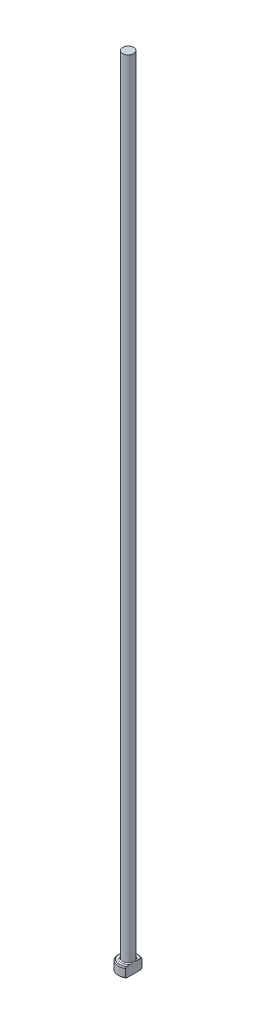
ISO-10303-21;
HEADER;
FILE_DESCRIPTION(('STEP AP214'),'2;1');
FILE_NAME('part.step','',(''),(''),'','','');
FILE_SCHEMA(('AUTOMOTIVE_DESIGN { 1 0 10303 214 1 1 1 1 }'));
ENDSEC;
DATA;
#1=APPLICATION_CONTEXT('core data for automotive mechanical design processes');
#2=APPLICATION_PROTOCOL_DEFINITION('international standard','automotive_design',2000,#1);
#3=PRODUCT_CONTEXT('',#1,'mechanical');
#4=PRODUCT('Part','Part','',(#3));
#5=PRODUCT_RELATED_PRODUCT_CATEGORY('part','',(#4));
#6=PRODUCT_DEFINITION_FORMATION('','',#4);
#7=PRODUCT_DEFINITION_CONTEXT('part definition',#1,'design');
#8=PRODUCT_DEFINITION('design','',#6,#7);
#9=PRODUCT_DEFINITION_SHAPE('','',#8);
#10=(LENGTH_UNIT() NAMED_UNIT(*) SI_UNIT(.MILLI.,.METRE.));
#11=(NAMED_UNIT(*) PLANE_ANGLE_UNIT() SI_UNIT($,.RADIAN.));
#12=(NAMED_UNIT(*) SI_UNIT($,.STERADIAN.) SOLID_ANGLE_UNIT());
#13=UNCERTAINTY_MEASURE_WITH_UNIT(LENGTH_MEASURE(1.E-05),#10,'distance_accuracy_value','');
#14=(GEOMETRIC_REPRESENTATION_CONTEXT(3) GLOBAL_UNCERTAINTY_ASSIGNED_CONTEXT((#13)) GLOBAL_UNIT_ASSIGNED_CONTEXT((#10,
#11,#12)) REPRESENTATION_CONTEXT('',''));
#15=CARTESIAN_POINT('',(0.,0.,0.));
#16=DIRECTION('',(0.,0.,1.));
#17=DIRECTION('',(1.,0.,0.));
#18=AXIS2_PLACEMENT_3D('',#15,#16,#17);
#19=CARTESIAN_POINT('',(0.,0.,0.));
#20=DIRECTION('',(0.,-1.,0.));
#21=DIRECTION('',(0.,0.,-1.));
#22=AXIS2_PLACEMENT_3D('',#19,#20,#21);
#23=PLANE('',#22);
#24=CARTESIAN_POINT('',(0.,0.,0.));
#25=DIRECTION('',(0.,-1.,0.));
#26=DIRECTION('',(0.,0.,-1.));
#27=AXIS2_PLACEMENT_3D('',#24,#25,#26);
#28=CIRCLE('',#27,1.79999999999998);
#29=CARTESIAN_POINT('',(1.09999999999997,0.,1.4247806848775));
#30=VERTEX_POINT('',#29);
#31=CARTESIAN_POINT('',(1.09999999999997,0.,-1.4247806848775));
#32=VERTEX_POINT('',#31);
#33=EDGE_CURVE('E98',#30,#32,#28,.T.);
#34=ORIENTED_EDGE('',*,*,#33,.T.);
#35=DIRECTION('',(0.,0.,1.));
#36=VECTOR('',#35,1.);
#37=CARTESIAN_POINT('',(1.09999999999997,0.,-1.67032930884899));
#38=LINE('',#37,#36);
#39=EDGE_CURVE('E83',#32,#30,#38,.T.);
#40=ORIENTED_EDGE('',*,*,#39,.T.);
#41=EDGE_LOOP('',(#34,#40));
#42=FACE_BOUND('',#41,.T.);
#43=ADVANCED_FACE('F32',(#42),#23,.T.);
#44=CARTESIAN_POINT('',(0.,259.958771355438,0.));
#45=DIRECTION('',(0.,1.,0.));
#46=DIRECTION('',(0.,0.,1.));
#47=AXIS2_PLACEMENT_3D('',#44,#45,#46);
#48=CYLINDRICAL_SURFACE('',#47,1.99999999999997);
#49=CARTESIAN_POINT('',(0.,1.79999999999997,0.));
#50=DIRECTION('',(0.,1.,0.));
#51=DIRECTION('',(0.,0.,1.));
#52=AXIS2_PLACEMENT_3D('',#49,#50,#51);
#53=CIRCLE('',#52,1.99999999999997);
#54=CARTESIAN_POINT('',(1.09999999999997,1.79999999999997,1.67032930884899));
#55=VERTEX_POINT('',#54);
#56=CARTESIAN_POINT('',(1.09999999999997,1.79999999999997,-1.67032930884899));
#57=VERTEX_POINT('',#56);
#58=EDGE_CURVE('E104',#55,#57,#53,.F.);
#59=ORIENTED_EDGE('',*,*,#58,.T.);
#60=DIRECTION('',(0.,-1.,0.));
#61=VECTOR('',#60,1.);
#62=CARTESIAN_POINT('',(1.09999999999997,160.,-1.67032930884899));
#63=LINE('',#62,#61);
#64=CARTESIAN_POINT('',(1.09999999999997,0.199999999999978,-1.67032930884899));
#65=VERTEX_POINT('',#64);
#66=EDGE_CURVE('E183',#57,#65,#63,.T.);
#67=ORIENTED_EDGE('',*,*,#66,.T.);
#68=CARTESIAN_POINT('',(0.,0.199999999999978,0.));
#69=DIRECTION('',(0.,-1.,0.));
#70=DIRECTION('',(0.,0.,-1.));
#71=AXIS2_PLACEMENT_3D('',#68,#69,#70);
#72=CIRCLE('',#71,1.99999999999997);
#73=CARTESIAN_POINT('',(1.09999999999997,0.199999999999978,1.67032930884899));
#74=VERTEX_POINT('',#73);
#75=EDGE_CURVE('E100',#65,#74,#72,.F.);
#76=ORIENTED_EDGE('',*,*,#75,.T.);
#77=DIRECTION('',(0.,-1.,0.));
#78=VECTOR('',#77,1.);
#79=CARTESIAN_POINT('',(1.09999999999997,160.,1.67032930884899));
#80=LINE('',#79,#78);
#81=EDGE_CURVE('E93',#55,#74,#80,.T.);
#82=ORIENTED_EDGE('',*,*,#81,.F.);
#83=EDGE_LOOP('',(#59,#67,#76,#82));
#84=FACE_BOUND('',#83,.T.);
#85=ADVANCED_FACE('F158',(#84),#48,.T.);
#86=CARTESIAN_POINT('',(-1.99999999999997,2.,0.));
#87=DIRECTION('',(0.,1.,0.));
#88=DIRECTION('',(0.,0.,1.));
#89=AXIS2_PLACEMENT_3D('',#86,#87,#88);
#90=PLANE('',#89);
#91=CARTESIAN_POINT('',(0.,2.,0.));
#92=DIRECTION('',(0.,1.,0.));
#93=DIRECTION('',(0.,0.,1.));
#94=AXIS2_PLACEMENT_3D('',#91,#92,#93);
#95=CIRCLE('',#94,1.79999999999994);
#96=CARTESIAN_POINT('',(1.09999999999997,2.,-1.42478068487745));
#97=VERTEX_POINT('',#96);
#98=CARTESIAN_POINT('',(1.09999999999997,2.,1.42478068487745));
#99=VERTEX_POINT('',#98);
#100=EDGE_CURVE('E178',#97,#99,#95,.T.);
#101=ORIENTED_EDGE('',*,*,#100,.T.);
#102=DIRECTION('',(0.,0.,-1.));
#103=VECTOR('',#102,1.);
#104=CARTESIAN_POINT('',(1.09999999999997,2.,0.));
#105=LINE('',#104,#103);
#106=CARTESIAN_POINT('',(1.09999999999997,1.99999999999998,0.692820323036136));
#107=VERTEX_POINT('',#106);
#108=EDGE_CURVE('E57',#99,#107,#105,.T.);
#109=ORIENTED_EDGE('',*,*,#108,.T.);
#110=CARTESIAN_POINT('',(0.,2.,0.));
#111=DIRECTION('',(0.,1.,0.));
#112=DIRECTION('',(0.,0.,1.));
#113=AXIS2_PLACEMENT_3D('',#110,#111,#112);
#114=CIRCLE('',#113,1.29999999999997);
#115=CARTESIAN_POINT('',(1.09999999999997,1.99999999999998,-0.692820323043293));
#116=VERTEX_POINT('',#115);
#117=EDGE_CURVE('E107',#107,#116,#114,.F.);
#118=ORIENTED_EDGE('',*,*,#117,.T.);
#119=EDGE_CURVE('E136',#116,#97,#105,.T.);
#120=ORIENTED_EDGE('',*,*,#119,.T.);
#121=EDGE_LOOP('',(#101,#109,#118,#120));
#122=FACE_BOUND('',#121,.T.);
#123=ADVANCED_FACE('F147',(#122),#90,.T.);
#124=CARTESIAN_POINT('',(0.,2.,0.));
#125=DIRECTION('',(0.,-1.,0.));
#126=DIRECTION('',(0.,0.,-1.));
#127=AXIS2_PLACEMENT_3D('',#124,#125,#126);
#128=CONICAL_SURFACE('',#127,1.79999999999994,0.785398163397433);
#129=ORIENTED_EDGE('',*,*,#58,.F.);
#130=CARTESIAN_POINT('',(1.09999999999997,-0.0394609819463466,3.67851337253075));
#131=CARTESIAN_POINT('',(1.09999999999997,0.0938871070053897,3.53927086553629));
#132=CARTESIAN_POINT('',(1.09999999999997,0.226969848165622,3.39976850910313));
#133=CARTESIAN_POINT('',(1.09999999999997,0.492235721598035,3.11984283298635));
#134=CARTESIAN_POINT('',(1.09999999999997,0.624418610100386,2.97941928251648));
#135=CARTESIAN_POINT('',(1.09999999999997,0.887405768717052,2.69736523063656));
#136=CARTESIAN_POINT('',(1.09999999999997,1.01821044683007,2.55573511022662));
#137=CARTESIAN_POINT('',(1.09999999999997,1.27771059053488,2.27057337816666));
#138=CARTESIAN_POINT('',(1.09999999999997,1.40640632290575,2.12704201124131));
#139=CARTESIAN_POINT('',(1.09999999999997,1.59274008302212,1.91391242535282));
#140=CARTESIAN_POINT('',(1.09999999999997,1.65179690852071,1.84555665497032));
#141=CARTESIAN_POINT('',(1.09999999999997,1.76883123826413,1.7079133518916));
#142=CARTESIAN_POINT('',(1.09999999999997,1.82680864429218,1.63862573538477));
#143=CARTESIAN_POINT('',(1.09999999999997,1.94139081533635,1.49868129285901));
#144=CARTESIAN_POINT('',(1.09999999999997,1.99799249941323,1.42802193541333));
#145=CARTESIAN_POINT('',(1.09999999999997,2.10905321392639,1.28504453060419));
#146=CARTESIAN_POINT('',(1.09999999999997,2.16351265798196,1.21272680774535));
#147=CARTESIAN_POINT('',(1.09999999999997,2.25351962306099,1.08760351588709));
#148=CARTESIAN_POINT('',(1.09999999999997,2.28987864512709,1.03538457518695));
#149=CARTESIAN_POINT('',(1.09999999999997,2.36041465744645,0.92949954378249));
#150=CARTESIAN_POINT('',(1.09999999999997,2.39459216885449,0.875833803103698));
#151=CARTESIAN_POINT('',(1.09999999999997,2.45984644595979,0.766757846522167));
#152=CARTESIAN_POINT('',(1.09999999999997,2.49092891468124,0.711351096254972));
#153=CARTESIAN_POINT('',(1.09999999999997,2.54873716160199,0.598347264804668));
#154=CARTESIAN_POINT('',(1.09999999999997,2.57546692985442,0.540752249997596));
#155=CARTESIAN_POINT('',(1.09999999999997,2.62531671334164,0.41646762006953));
#156=CARTESIAN_POINT('',(1.09999999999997,2.64771917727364,0.349473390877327));
#157=CARTESIAN_POINT('',(1.09999999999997,2.67308404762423,0.247046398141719));
#158=CARTESIAN_POINT('',(1.09999999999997,2.68016204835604,0.212626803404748));
#159=CARTESIAN_POINT('',(1.09999999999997,2.69123178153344,0.143302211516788));
#160=CARTESIAN_POINT('',(1.09999999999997,2.69522514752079,0.108397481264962));
#161=CARTESIAN_POINT('',(1.09999999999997,2.6999066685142,0.0380394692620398));
#162=CARTESIAN_POINT('',(1.09999999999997,2.70056409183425,0.00258409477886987));
#163=CARTESIAN_POINT('',(1.09999999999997,2.69845711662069,-0.0682167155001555));
#164=CARTESIAN_POINT('',(1.09999999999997,2.695692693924,-0.103562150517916));
#165=CARTESIAN_POINT('',(1.09999999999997,2.68246916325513,-0.209100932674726));
#166=CARTESIAN_POINT('',(1.09999999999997,2.66707429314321,-0.278705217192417));
#167=CARTESIAN_POINT('',(1.09999999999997,2.6311290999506,-0.398409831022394));
#168=CARTESIAN_POINT('',(1.09999999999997,2.61268926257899,-0.449196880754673));
#169=CARTESIAN_POINT('',(1.09999999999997,2.5714477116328,-0.548998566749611));
#170=CARTESIAN_POINT('',(1.09999999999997,2.5486426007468,-0.598011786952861));
#171=CARTESIAN_POINT('',(1.09999999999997,2.49970814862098,-0.694626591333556));
#172=CARTESIAN_POINT('',(1.09999999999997,2.47356275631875,-0.74221989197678));
#173=CARTESIAN_POINT('',(1.09999999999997,2.41890398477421,-0.835986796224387));
#174=CARTESIAN_POINT('',(1.09999999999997,2.39039158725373,-0.882160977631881));
#175=CARTESIAN_POINT('',(1.09999999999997,2.32625511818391,-0.981643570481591));
#176=CARTESIAN_POINT('',(1.09999999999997,2.2902800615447,-1.03472421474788));
#177=CARTESIAN_POINT('',(1.09999999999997,2.21653305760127,-1.13962743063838));
#178=CARTESIAN_POINT('',(1.09999999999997,2.17876074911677,-1.19144974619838));
#179=CARTESIAN_POINT('',(1.09999999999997,2.06341857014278,-1.34551007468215));
#180=CARTESIAN_POINT('',(1.09999999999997,1.98387469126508,-1.44626517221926));
#181=CARTESIAN_POINT('',(1.09999999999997,1.82152847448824,-1.64549240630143));
#182=CARTESIAN_POINT('',(1.09999999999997,1.73871851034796,-1.74395822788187));
#183=CARTESIAN_POINT('',(1.09999999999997,1.57115072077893,-1.93914128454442));
#184=CARTESIAN_POINT('',(1.09999999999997,1.48639373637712,-2.03585924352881));
#185=CARTESIAN_POINT('',(1.09999999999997,1.3154590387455,-2.22820182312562));
#186=CARTESIAN_POINT('',(1.09999999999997,1.22927997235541,-2.32382523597));
#187=CARTESIAN_POINT('',(1.09999999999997,1.05596320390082,-2.51421569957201));
#188=CARTESIAN_POINT('',(1.09999999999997,0.968825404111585,-2.6089826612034));
#189=CARTESIAN_POINT('',(1.09999999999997,0.706597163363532,-2.89210208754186));
#190=CARTESIAN_POINT('',(1.09999999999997,0.530482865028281,-3.07950542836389));
#191=CARTESIAN_POINT('',(1.09999999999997,0.28821930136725,-3.33512571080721));
#192=CARTESIAN_POINT('',(1.09999999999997,0.222748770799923,-3.40399021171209));
#193=CARTESIAN_POINT('',(1.09999999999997,0.0917246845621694,-3.54143252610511));
#194=CARTESIAN_POINT('',(1.09999999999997,0.0261714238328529,-3.61001062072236));
#195=CARTESIAN_POINT('',(1.09999999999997,-0.0394609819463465,-3.67851337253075));
#196=B_SPLINE_CURVE_WITH_KNOTS('',3,(#130,#131,#132,#133,#134,#135,#136,#137,#138,#139,#140,
#141,#142,#143,#144,#145,#146,#147,#148,#149,#150,#151,#152,#153,#154,#155,#156,#157,#158,#159,
#160,#161,#162,#163,#164,#165,#166,#167,#168,#169,#170,#171,#172,#173,#174,#175,#176,#177,#178,
#179,#180,#181,#182,#183,#184,#185,#186,#187,#188,#189,#190,#191,#192,#193,#194,#195),
.UNSPECIFIED.,.F.,.F.,(4,2,2,2,2,2,2,2,2,2,2,2,2,2,2,2,2,2,2,2,2,2,2,2,2,2,2,2,2,2,2,2,4),(0.,
0.578393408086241,1.15693772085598,1.73530565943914,2.31359986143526,2.58459381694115,
2.85561231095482,3.12719032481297,3.39871564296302,3.58956709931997,3.78037278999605,
3.97082012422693,4.16109188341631,4.37223430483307,4.47753596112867,4.58278181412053,
4.68899548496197,4.79520990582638,5.00790932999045,5.16979123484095,5.33179964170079,
5.49461809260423,5.65736934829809,5.84968611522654,6.042041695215,6.42702818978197,
6.81297408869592,7.1987562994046,7.58492959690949,7.97114262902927,8.74263124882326,
9.02768991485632,9.3122978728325),.UNSPECIFIED.);
#197=EDGE_CURVE('E135',#55,#99,#196,.T.);
#198=ORIENTED_EDGE('',*,*,#197,.T.);
#199=ORIENTED_EDGE('',*,*,#100,.F.);
#200=EDGE_CURVE('E127',#97,#57,#196,.T.);
#201=ORIENTED_EDGE('',*,*,#200,.T.);
#202=EDGE_LOOP('',(#129,#198,#199,#201));
#203=FACE_BOUND('',#202,.T.);
#204=ADVANCED_FACE('F143',(#203),#128,.T.);
#205=CARTESIAN_POINT('',(0.,0.199999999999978,0.));
#206=DIRECTION('',(0.,1.,0.));
#207=DIRECTION('',(0.,0.,1.));
#208=AXIS2_PLACEMENT_3D('',#205,#206,#207);
#209=CONICAL_SURFACE('',#208,1.99999999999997,0.785398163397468);
#210=ORIENTED_EDGE('',*,*,#75,.F.);
#211=CARTESIAN_POINT('',(1.09999999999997,2.03946098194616,-3.67851337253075));
#212=CARTESIAN_POINT('',(1.09999999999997,1.90611289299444,-3.53927086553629));
#213=CARTESIAN_POINT('',(1.09999999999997,1.77303015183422,-3.39976850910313));
#214=CARTESIAN_POINT('',(1.09999999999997,1.50776427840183,-3.11984283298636));
#215=CARTESIAN_POINT('',(1.09999999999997,1.37558138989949,-2.9794192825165));
#216=CARTESIAN_POINT('',(1.09999999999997,1.11259423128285,-2.69736523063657));
#217=CARTESIAN_POINT('',(1.09999999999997,0.981789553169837,-2.55573511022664));
#218=CARTESIAN_POINT('',(1.09999999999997,0.722289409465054,-2.27057337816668));
#219=CARTESIAN_POINT('',(1.09999999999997,0.593593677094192,-2.12704201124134));
#220=CARTESIAN_POINT('',(1.09999999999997,0.407259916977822,-1.91391242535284));
#221=CARTESIAN_POINT('',(1.09999999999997,0.348203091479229,-1.84555665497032));
#222=CARTESIAN_POINT('',(1.09999999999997,0.231168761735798,-1.70791335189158));
#223=CARTESIAN_POINT('',(1.09999999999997,0.173191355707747,-1.63862573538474));
#224=CARTESIAN_POINT('',(1.09999999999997,0.0586091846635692,-1.49868129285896));
#225=CARTESIAN_POINT('',(1.09999999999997,0.00200750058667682,-1.42802193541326));
#226=CARTESIAN_POINT('',(1.09999999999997,-0.10905321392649,-1.2850445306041));
#227=CARTESIAN_POINT('',(1.09999999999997,-0.163512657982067,-1.21272680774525));
#228=CARTESIAN_POINT('',(1.09999999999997,-0.253519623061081,-1.08760351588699));
#229=CARTESIAN_POINT('',(1.09999999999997,-0.289878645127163,-1.03538457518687));
#230=CARTESIAN_POINT('',(1.09999999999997,-0.360414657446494,-0.929499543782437));
#231=CARTESIAN_POINT('',(1.09999999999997,-0.394592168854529,-0.87583380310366));
#232=CARTESIAN_POINT('',(1.09999999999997,-0.459846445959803,-0.76675784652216));
#233=CARTESIAN_POINT('',(1.09999999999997,-0.490928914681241,-0.711351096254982));
#234=CARTESIAN_POINT('',(1.09999999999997,-0.548737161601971,-0.598347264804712));
#235=CARTESIAN_POINT('',(1.09999999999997,-0.575466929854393,-0.540752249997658));
#236=CARTESIAN_POINT('',(1.09999999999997,-0.625316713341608,-0.416467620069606));
#237=CARTESIAN_POINT('',(1.09999999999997,-0.647719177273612,-0.349473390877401));
#238=CARTESIAN_POINT('',(1.09999999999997,-0.673084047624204,-0.247046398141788));
#239=CARTESIAN_POINT('',(1.09999999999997,-0.680162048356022,-0.212626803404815));
#240=CARTESIAN_POINT('',(1.09999999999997,-0.691231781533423,-0.143302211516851));
#241=CARTESIAN_POINT('',(1.09999999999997,-0.695225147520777,-0.108397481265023));
#242=CARTESIAN_POINT('',(1.09999999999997,-0.699906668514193,-0.0380394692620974));
#243=CARTESIAN_POINT('',(1.09999999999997,-0.700564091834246,-0.00258409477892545));
#244=CARTESIAN_POINT('',(1.09999999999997,-0.698457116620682,0.0682167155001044));
#245=CARTESIAN_POINT('',(1.09999999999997,-0.695692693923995,0.103562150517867));
#246=CARTESIAN_POINT('',(1.09999999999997,-0.682469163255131,0.209100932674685));
#247=CARTESIAN_POINT('',(1.09999999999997,-0.667074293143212,0.27870521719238));
#248=CARTESIAN_POINT('',(1.09999999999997,-0.631129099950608,0.398409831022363));
#249=CARTESIAN_POINT('',(1.09999999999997,-0.612689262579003,0.449196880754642));
#250=CARTESIAN_POINT('',(1.09999999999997,-0.571447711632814,0.548998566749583));
#251=CARTESIAN_POINT('',(1.09999999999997,-0.548642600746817,0.598011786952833));
#252=CARTESIAN_POINT('',(1.09999999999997,-0.499708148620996,0.69462659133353));
#253=CARTESIAN_POINT('',(1.09999999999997,-0.473562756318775,0.742219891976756));
#254=CARTESIAN_POINT('',(1.09999999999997,-0.418903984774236,0.835986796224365));
#255=CARTESIAN_POINT('',(1.09999999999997,-0.390391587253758,0.882160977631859));
#256=CARTESIAN_POINT('',(1.09999999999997,-0.326255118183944,0.981643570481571));
#257=CARTESIAN_POINT('',(1.09999999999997,-0.290280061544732,1.03472421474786));
#258=CARTESIAN_POINT('',(1.09999999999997,-0.216533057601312,1.13962743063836));
#259=CARTESIAN_POINT('',(1.09999999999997,-0.178760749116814,1.19144974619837));
#260=CARTESIAN_POINT('',(1.09999999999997,-0.0634185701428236,1.34551007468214));
#261=CARTESIAN_POINT('',(1.09999999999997,0.0161253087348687,1.44626517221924));
#262=CARTESIAN_POINT('',(1.09999999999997,0.1784715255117,1.64549240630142));
#263=CARTESIAN_POINT('',(1.09999999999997,0.261281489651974,1.74395822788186));
#264=CARTESIAN_POINT('',(1.09999999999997,0.428849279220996,1.93914128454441));
#265=CARTESIAN_POINT('',(1.09999999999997,0.5136062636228,2.0358592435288));
#266=CARTESIAN_POINT('',(1.09999999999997,0.684540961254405,2.22820182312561));
#267=CARTESIAN_POINT('',(1.09999999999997,0.770720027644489,2.32382523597));
#268=CARTESIAN_POINT('',(1.09999999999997,0.944036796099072,2.514215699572));
#269=CARTESIAN_POINT('',(1.09999999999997,1.0311745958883,2.60898266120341));
#270=CARTESIAN_POINT('',(1.09999999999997,1.29340283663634,2.89210208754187));
#271=CARTESIAN_POINT('',(1.09999999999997,1.46951713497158,3.0795054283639));
#272=CARTESIAN_POINT('',(1.09999999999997,1.7117806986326,3.33512571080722));
#273=CARTESIAN_POINT('',(1.09999999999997,1.77725122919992,3.40399021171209));
#274=CARTESIAN_POINT('',(1.09999999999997,1.90827531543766,3.54143252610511));
#275=CARTESIAN_POINT('',(1.09999999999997,1.97382857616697,3.61001062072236));
#276=CARTESIAN_POINT('',(1.09999999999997,2.03946098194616,3.67851337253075));
#277=B_SPLINE_CURVE_WITH_KNOTS('',3,(#211,#212,#213,#214,#215,#216,#217,#218,#219,#220,#221,
#222,#223,#224,#225,#226,#227,#228,#229,#230,#231,#232,#233,#234,#235,#236,#237,#238,#239,#240,
#241,#242,#243,#244,#245,#246,#247,#248,#249,#250,#251,#252,#253,#254,#255,#256,#257,#258,#259,
#260,#261,#262,#263,#264,#265,#266,#267,#268,#269,#270,#271,#272,#273,#274,#275,#276),
.UNSPECIFIED.,.F.,.F.,(4,2,2,2,2,2,2,2,2,2,2,2,2,2,2,2,2,2,2,2,2,2,2,2,2,2,2,2,2,2,2,2,4),(0.,
0.57839340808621,1.15693772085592,1.73530565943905,2.31359986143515,2.58459381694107,
2.85561231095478,3.12719032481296,3.39871564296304,3.58956709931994,3.78037278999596,
3.97082012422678,4.1610918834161,4.37223430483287,4.47753596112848,4.58278181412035,
4.6889954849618,4.79520990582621,5.00790932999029,5.1697912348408,5.33179964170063,
5.49461809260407,5.65736934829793,5.84968611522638,6.04204169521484,6.4270281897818,
6.81297408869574,7.19875629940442,7.5849295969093,7.97114262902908,8.74263124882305,
9.02768991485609,9.31229787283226),.UNSPECIFIED.);
#278=EDGE_CURVE('E86',#65,#32,#277,.T.);
#279=ORIENTED_EDGE('',*,*,#278,.T.);
#280=ORIENTED_EDGE('',*,*,#33,.F.);
#281=EDGE_CURVE('E89',#30,#74,#277,.T.);
#282=ORIENTED_EDGE('',*,*,#281,.T.);
#283=EDGE_LOOP('',(#210,#279,#280,#282));
#284=FACE_BOUND('',#283,.T.);
#285=ADVANCED_FACE('F97',(#284),#209,.T.);
#286=CARTESIAN_POINT('',(0.,2.19999999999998,0.));
#287=DIRECTION('',(0.,1.,0.));
#288=DIRECTION('',(0.,0.,1.));
#289=AXIS2_PLACEMENT_3D('',#286,#287,#288);
#290=TOROIDAL_SURFACE('',#289,1.29999999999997,0.2);
#291=CARTESIAN_POINT('',(1.09999999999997,2.19999999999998,0.));
#292=CARTESIAN_POINT('',(1.09999999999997,2.20000051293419,3.6073967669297E-11));
#293=CARTESIAN_POINT('',(1.09999999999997,2.20000102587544,-9.99111383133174E-08));
#294=CARTESIAN_POINT('',(1.09999999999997,2.20000201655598,-4.21307805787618E-07));
#295=CARTESIAN_POINT('',(1.09999999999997,2.20000249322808,-6.45471450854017E-07));
#296=CARTESIAN_POINT('',(1.09999999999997,2.20000344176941,-1.18549609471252E-06));
#297=CARTESIAN_POINT('',(1.09999999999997,2.20000391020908,-1.50725452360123E-06));
#298=CARTESIAN_POINT('',(1.09999999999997,2.20000479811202,-2.20431303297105E-06));
#299=CARTESIAN_POINT('',(1.09999999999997,2.20000521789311,-2.5792253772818E-06));
#300=CARTESIAN_POINT('',(1.09999999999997,2.2000066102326,-3.91337800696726E-06));
#301=CARTESIAN_POINT('',(1.09999999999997,2.20000751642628,-4.94273423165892E-06));
#302=CARTESIAN_POINT('',(1.09999999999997,2.20000914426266,-7.08045055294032E-06));
#303=CARTESIAN_POINT('',(1.09999999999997,2.20000987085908,-8.18525581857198E-06));
#304=CARTESIAN_POINT('',(1.09999999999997,2.20001256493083,-1.24548986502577E-05));
#305=CARTESIAN_POINT('',(1.09999999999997,2.20001438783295,-1.57147536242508E-05));
#306=CARTESIAN_POINT('',(1.09999999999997,2.20001740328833,-2.21764542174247E-05));
#307=CARTESIAN_POINT('',(1.09999999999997,2.20001863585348,-2.53602841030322E-05));
#308=CARTESIAN_POINT('',(1.09999999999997,2.20002381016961,-3.88057522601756E-05));
#309=CARTESIAN_POINT('',(1.09999999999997,2.20002769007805,-4.90846952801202E-05));
#310=CARTESIAN_POINT('',(1.09999999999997,2.20003398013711,-6.83950902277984E-05));
#311=CARTESIAN_POINT('',(1.09999999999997,2.2000365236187,-7.73813874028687E-05));
#312=CARTESIAN_POINT('',(1.09999999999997,2.20005650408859,-0.000142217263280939));
#313=CARTESIAN_POINT('',(1.09999999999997,2.2000817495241,-0.000195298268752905));
#314=CARTESIAN_POINT('',(1.09999999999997,2.20017599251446,-0.00040106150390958));
#315=CARTESIAN_POINT('',(1.09999999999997,2.20023918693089,-0.000555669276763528));
#316=CARTESIAN_POINT('',(1.09999999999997,2.20048725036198,-0.00115356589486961));
#317=CARTESIAN_POINT('',(1.09999999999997,2.20067820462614,-0.00159487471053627));
#318=CARTESIAN_POINT('',(1.09999999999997,2.20145114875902,-0.00338993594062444));
#319=CARTESIAN_POINT('',(1.09999999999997,2.20202628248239,-0.00474587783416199));
#320=CARTESIAN_POINT('',(1.09999999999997,2.20972642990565,-0.0228890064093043));
#321=CARTESIAN_POINT('',(1.09999999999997,2.21689763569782,-0.0396618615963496));
#322=CARTESIAN_POINT('',(1.09999999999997,2.23088776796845,-0.0726432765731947));
#323=CARTESIAN_POINT('',(1.09999999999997,2.23771010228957,-0.0888504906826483));
#324=CARTESIAN_POINT('',(1.09999999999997,2.2520105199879,-0.12316170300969));
#325=CARTESIAN_POINT('',(1.09999999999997,2.25947482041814,-0.141271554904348));
#326=CARTESIAN_POINT('',(1.09999999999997,2.27424285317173,-0.177765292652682));
#327=CARTESIAN_POINT('',(1.09999999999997,2.28154426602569,-0.196150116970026));
#328=CARTESIAN_POINT('',(1.09999999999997,2.29932484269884,-0.242089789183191));
#329=CARTESIAN_POINT('',(1.09999999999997,2.30960714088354,-0.269721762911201));
#330=CARTESIAN_POINT('',(1.09999999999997,2.32891385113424,-0.324725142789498));
#331=CARTESIAN_POINT('',(1.09999999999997,2.33796145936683,-0.352088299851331));
#332=CARTESIAN_POINT('',(1.09999999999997,2.35364474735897,-0.40369058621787));
#333=CARTESIAN_POINT('',(1.09999999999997,2.36044093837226,-0.427880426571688));
#334=CARTESIAN_POINT('',(1.09999999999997,2.37278398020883,-0.47674569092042));
#335=CARTESIAN_POINT('',(1.09999999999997,2.37832261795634,-0.501423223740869));
#336=CARTESIAN_POINT('',(1.09999999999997,2.38801040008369,-0.552403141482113));
#337=CARTESIAN_POINT('',(1.09999999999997,2.39207120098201,-0.578722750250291));
#338=CARTESIAN_POINT('',(1.09999999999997,2.39789224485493,-0.631611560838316));
#339=CARTESIAN_POINT('',(1.09999999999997,2.39965448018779,-0.658180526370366));
#340=CARTESIAN_POINT('',(1.09999999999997,2.40018565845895,-0.705278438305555));
#341=CARTESIAN_POINT('',(1.09999999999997,2.39954710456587,-0.725798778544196));
#342=CARTESIAN_POINT('',(1.09999999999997,2.39616992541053,-0.766506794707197));
#343=CARTESIAN_POINT('',(1.09999999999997,2.39344923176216,-0.786695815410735));
#344=CARTESIAN_POINT('',(1.09999999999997,2.38541819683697,-0.826869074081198));
#345=CARTESIAN_POINT('',(1.09999999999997,2.38007173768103,-0.846846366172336));
#346=CARTESIAN_POINT('',(1.09999999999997,2.36615936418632,-0.885705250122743));
#347=CARTESIAN_POINT('',(1.09999999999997,2.35759666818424,-0.904587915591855));
#348=CARTESIAN_POINT('',(1.09999999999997,2.3413093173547,-0.932102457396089));
#349=CARTESIAN_POINT('',(1.09999999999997,2.33493263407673,-0.94153212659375));
#350=CARTESIAN_POINT('',(1.09999999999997,2.32089802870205,-0.959389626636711));
#351=CARTESIAN_POINT('',(1.09999999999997,2.31324176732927,-0.967818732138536));
#352=CARTESIAN_POINT('',(1.09999999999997,2.29794985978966,-0.982021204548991));
#353=CARTESIAN_POINT('',(1.09999999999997,2.2905098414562,-0.988003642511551));
#354=CARTESIAN_POINT('',(1.09999999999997,2.27474667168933,-0.998671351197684));
#355=CARTESIAN_POINT('',(1.09999999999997,2.26642452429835,-1.00335807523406));
#356=CARTESIAN_POINT('',(1.09999999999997,2.25045003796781,-1.01049114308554));
#357=CARTESIAN_POINT('',(1.09999999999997,2.24290483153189,-1.01317643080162));
#358=CARTESIAN_POINT('',(1.09999999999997,2.22746947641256,-1.01724295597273));
#359=CARTESIAN_POINT('',(1.09999999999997,2.21957951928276,-1.01862490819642));
#360=CARTESIAN_POINT('',(1.09999999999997,2.20365797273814,-1.0199891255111));
#361=CARTESIAN_POINT('',(1.09999999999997,2.19562607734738,-1.01996786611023));
#362=CARTESIAN_POINT('',(1.09999999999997,2.17969084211,-1.01851853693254));
#363=CARTESIAN_POINT('',(1.09999999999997,2.1717875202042,-1.01709027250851));
#364=CARTESIAN_POINT('',(1.09999999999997,2.15661212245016,-1.01300324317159));
#365=CARTESIAN_POINT('',(1.09999999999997,2.14932759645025,-1.01038998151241));
#366=CARTESIAN_POINT('',(1.09999999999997,2.13523656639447,-1.00410166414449));
#367=CARTESIAN_POINT('',(1.09999999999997,2.12843022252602,-1.00042625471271));
#368=CARTESIAN_POINT('',(1.09999999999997,2.11281201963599,-0.990557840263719));
#369=CARTESIAN_POINT('',(1.09999999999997,2.10426616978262,-0.983943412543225));
#370=CARTESIAN_POINT('',(1.09999999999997,2.08835473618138,-0.969418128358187));
#371=CARTESIAN_POINT('',(1.09999999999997,2.08099195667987,-0.961504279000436));
#372=CARTESIAN_POINT('',(1.09999999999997,2.06451454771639,-0.941147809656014));
#373=CARTESIAN_POINT('',(1.09999999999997,2.05600335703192,-0.928218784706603));
#374=CARTESIAN_POINT('',(1.09999999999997,2.04111601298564,-0.901229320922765));
#375=CARTESIAN_POINT('',(1.09999999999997,2.03473990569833,-0.887168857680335));
#376=CARTESIAN_POINT('',(1.09999999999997,2.0205978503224,-0.849888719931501));
#377=CARTESIAN_POINT('',(1.09999999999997,2.01422029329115,-0.826146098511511));
#378=CARTESIAN_POINT('',(1.09999999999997,2.0050305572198,-0.777766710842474));
#379=CARTESIAN_POINT('',(1.09999999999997,2.00226155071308,-0.753122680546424));
#380=CARTESIAN_POINT('',(1.09999999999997,1.99848820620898,-0.682856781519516));
#381=CARTESIAN_POINT('',(1.09999999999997,2.00093637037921,-0.637054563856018));
#382=CARTESIAN_POINT('',(1.09999999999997,2.0092928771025,-0.570140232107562));
#383=CARTESIAN_POINT('',(1.09999999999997,2.01272884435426,-0.548616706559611));
#384=CARTESIAN_POINT('',(1.09999999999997,2.02080692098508,-0.505905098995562));
#385=CARTESIAN_POINT('',(1.09999999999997,2.0254425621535,-0.484715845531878));
#386=CARTESIAN_POINT('',(1.09999999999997,2.03889892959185,-0.42948239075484));
#387=CARTESIAN_POINT('',(1.09999999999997,2.04852945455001,-0.395639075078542));
#388=CARTESIAN_POINT('',(1.09999999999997,2.06989966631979,-0.327791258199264));
#389=CARTESIAN_POINT('',(1.09999999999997,2.08168242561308,-0.293800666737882));
#390=CARTESIAN_POINT('',(1.09999999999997,2.10244380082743,-0.237493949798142));
#391=CARTESIAN_POINT('',(1.09999999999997,2.11105810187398,-0.21504099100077));
#392=CARTESIAN_POINT('',(1.09999999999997,2.12862794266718,-0.170525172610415));
#393=CARTESIAN_POINT('',(1.09999999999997,2.13757927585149,-0.14846064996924));
#394=CARTESIAN_POINT('',(1.09999999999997,2.15480867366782,-0.106697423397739));
#395=CARTESIAN_POINT('',(1.09999999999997,2.16306162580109,-0.0869881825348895));
#396=CARTESIAN_POINT('',(1.09999999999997,2.18002424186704,-0.0468908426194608));
#397=CARTESIAN_POINT('',(1.09999999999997,2.18873943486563,-0.0265049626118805));
#398=CARTESIAN_POINT('',(1.09999999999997,2.19797392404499,-0.00474531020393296));
#399=CARTESIAN_POINT('',(1.09999999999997,2.19854931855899,-0.00338881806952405));
#400=CARTESIAN_POINT('',(1.09999999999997,2.1993223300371,-0.00159362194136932));
#401=CARTESIAN_POINT('',(1.09999999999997,2.19951310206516,-0.00115273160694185));
#402=CARTESIAN_POINT('',(1.09999999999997,2.19976094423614,-0.000555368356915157));
#403=CARTESIAN_POINT('',(1.09999999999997,2.19982409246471,-0.000400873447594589));
#404=CARTESIAN_POINT('',(1.09999999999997,2.19991827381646,-0.000195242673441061));
#405=CARTESIAN_POINT('',(1.09999999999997,2.19994350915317,-0.000142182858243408));
#406=CARTESIAN_POINT('',(1.09999999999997,2.19996348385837,-7.73713511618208E-05));
#407=CARTESIAN_POINT('',(1.09999999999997,2.19996602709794,-6.83867125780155E-05));
#408=CARTESIAN_POINT('',(1.09999999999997,2.19997231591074,-4.90799325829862E-05));
#409=CARTESIAN_POINT('',(1.09999999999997,2.19997619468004,-3.88029010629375E-05));
#410=CARTESIAN_POINT('',(1.09999999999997,2.19998136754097,-2.53595805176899E-05));
#411=CARTESIAN_POINT('',(1.09999999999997,2.19998259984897,-2.21760163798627E-05));
#412=CARTESIAN_POINT('',(1.09999999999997,2.19998561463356,-1.57148108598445E-05));
#413=CARTESIAN_POINT('',(1.09999999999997,2.19998743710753,-1.24551761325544E-05));
#414=CARTESIAN_POINT('',(1.09999999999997,2.19999013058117,-8.18573740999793E-06));
#415=CARTESIAN_POINT('',(1.09999999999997,2.19999085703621,-7.08095311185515E-06));
#416=CARTESIAN_POINT('',(1.09999999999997,2.19999248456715,-4.94325032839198E-06));
#417=CARTESIAN_POINT('',(1.09999999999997,2.19999339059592,-3.9138854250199E-06));
#418=CARTESIAN_POINT('',(1.09999999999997,2.19999478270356,-2.57968679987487E-06));
#419=CARTESIAN_POINT('',(1.09999999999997,2.19999520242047,-2.2047544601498E-06));
#420=CARTESIAN_POINT('',(1.09999999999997,2.1999960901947,-1.50764450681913E-06));
#421=CARTESIAN_POINT('',(1.09999999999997,2.1999965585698,-1.18585452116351E-06));
#422=CARTESIAN_POINT('',(1.09999999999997,2.19999750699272,-6.45753424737E-07));
#423=CARTESIAN_POINT('',(1.09999999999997,2.1999979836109,-4.21546286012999E-07));
#424=CARTESIAN_POINT('',(1.09999999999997,2.19999897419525,-1.00044385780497E-07));
#425=CARTESIAN_POINT('',(1.09999999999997,2.1999994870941,-3.60719752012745E-11));
#426=CARTESIAN_POINT('',(1.09999999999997,2.19999999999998,0.));
#427=B_SPLINE_CURVE_WITH_KNOTS('',3,(#291,#292,#293,#294,#295,#296,#297,#298,#299,#300,#301,
#302,#303,#304,#305,#306,#307,#308,#309,#310,#311,#312,#313,#314,#315,#316,#317,#318,#319,#320,
#321,#322,#323,#324,#325,#326,#327,#328,#329,#330,#331,#332,#333,#334,#335,#336,#337,#338,#339,
#340,#341,#342,#343,#344,#345,#346,#347,#348,#349,#350,#351,#352,#353,#354,#355,#356,#357,#358,
#359,#360,#361,#362,#363,#364,#365,#366,#367,#368,#369,#370,#371,#372,#373,#374,#375,#376,#377,
#378,#379,#380,#381,#382,#383,#384,#385,#386,#387,#388,#389,#390,#391,#392,#393,#394,#395,#396,
#397,#398,#399,#400,#401,#402,#403,#404,#405,#406,#407,#408,#409,#410,#411,#412,#413,#414,#415,
#416,#417,#418,#419,#420,#421,#422,#423,#424,#425,#426),.UNSPECIFIED.,.T.,.F.,(4,2,2,2,2,2,2,2,
2,2,2,2,2,2,2,2,2,2,2,2,2,2,2,2,2,2,2,2,2,2,2,2,2,2,2,2,2,2,2,2,2,2,2,2,2,2,2,2,2,2,2,2,2,2,2,2,
2,2,2,2,2,2,2,2,2,2,2,4),(0.,1.53757781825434E-06,3.11015844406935E-06,4.80844102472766E-06,
6.49491820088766E-06,1.05889533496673E-05,1.4552753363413E-05,2.57199109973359E-05,
3.59516089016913E-05,6.89038245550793E-05,9.68952770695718E-05,0.000272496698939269,
0.000774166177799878,0.00221597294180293,0.00663537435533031,0.0613537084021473,
0.114108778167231,0.172870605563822,0.232213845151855,0.32064861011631,0.407082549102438,
0.482434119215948,0.558264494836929,0.638080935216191,0.717828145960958,0.779333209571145,
0.840314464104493,0.902159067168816,0.963941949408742,0.998002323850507,1.03201883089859,
1.06055188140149,1.08905279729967,1.1129756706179,1.136885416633,1.16085521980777,
1.18482833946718,1.20795004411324,1.23107945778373,1.26331905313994,1.29563397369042,
1.341811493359,1.38799000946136,1.46132993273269,1.53553947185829,1.67227413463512,
1.73765429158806,1.8026890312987,1.90816998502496,2.01605526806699,2.08819695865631,
2.15962670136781,2.22373012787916,2.29023422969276,2.2946554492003,2.29609588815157,
2.29659719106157,2.29677272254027,2.29680070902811,2.29683365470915,2.2968438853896,
2.29685505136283,2.29685901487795,2.29686310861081,2.29686479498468,2.2968664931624,
2.29686806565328,2.29686960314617),.UNSPECIFIED.);
#428=CARTESIAN_POINT('',(1.09999999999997,2.19999999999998,0.));
#429=VERTEX_POINT('',#428);
#430=EDGE_CURVE('E11',#116,#429,#427,.T.);
#431=ORIENTED_EDGE('',*,*,#430,.F.);
#432=ORIENTED_EDGE('',*,*,#117,.F.);
#433=CARTESIAN_POINT('',(1.09999999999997,2.19999999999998,0.));
#434=CARTESIAN_POINT('',(1.09999999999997,2.19999948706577,-3.60741074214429E-11));
#435=CARTESIAN_POINT('',(1.09999999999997,2.19999897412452,9.99111381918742E-08));
#436=CARTESIAN_POINT('',(1.09999999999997,2.19999798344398,4.21307805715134E-07));
#437=CARTESIAN_POINT('',(1.09999999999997,2.19999750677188,6.4547145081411E-07));
#438=CARTESIAN_POINT('',(1.09999999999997,2.19999655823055,1.18549609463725E-06));
#439=CARTESIAN_POINT('',(1.09999999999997,2.19999608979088,1.50725452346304E-06));
#440=CARTESIAN_POINT('',(1.09999999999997,2.19999520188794,2.20431303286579E-06));
#441=CARTESIAN_POINT('',(1.09999999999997,2.19999478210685,2.5792253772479E-06));
#442=CARTESIAN_POINT('',(1.09999999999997,2.19999338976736,3.91337800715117E-06));
#443=CARTESIAN_POINT('',(1.09999999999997,2.19999248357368,4.9427342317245E-06));
#444=CARTESIAN_POINT('',(1.09999999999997,2.1999908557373,7.08045055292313E-06));
#445=CARTESIAN_POINT('',(1.09999999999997,2.19999012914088,8.18525581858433E-06));
#446=CARTESIAN_POINT('',(1.09999999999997,2.19998743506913,1.2454898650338E-05));
#447=CARTESIAN_POINT('',(1.09999999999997,2.19998561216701,1.57147536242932E-05));
#448=CARTESIAN_POINT('',(1.09999999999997,2.19998259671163,2.21764542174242E-05));
#449=CARTESIAN_POINT('',(1.09999999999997,2.19998136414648,2.53602841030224E-05));
#450=CARTESIAN_POINT('',(1.09999999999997,2.19997618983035,3.88057522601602E-05));
#451=CARTESIAN_POINT('',(1.09999999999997,2.19997230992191,4.90846952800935E-05));
#452=CARTESIAN_POINT('',(1.09999999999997,2.19996601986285,6.83950902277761E-05));
#453=CARTESIAN_POINT('',(1.09999999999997,2.19996347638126,7.7381387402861E-05));
#454=CARTESIAN_POINT('',(1.09999999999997,2.19994349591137,0.000142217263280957));
#455=CARTESIAN_POINT('',(1.09999999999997,2.19991825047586,0.000195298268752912));
#456=CARTESIAN_POINT('',(1.09999999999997,2.1998240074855,0.000401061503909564));
#457=CARTESIAN_POINT('',(1.09999999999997,2.19976081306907,0.000555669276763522));
#458=CARTESIAN_POINT('',(1.09999999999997,2.19951274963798,0.00115356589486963));
#459=CARTESIAN_POINT('',(1.09999999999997,2.19932179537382,0.00159487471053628));
#460=CARTESIAN_POINT('',(1.09999999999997,2.19854885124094,0.00338993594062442));
#461=CARTESIAN_POINT('',(1.09999999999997,2.19797371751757,0.00474587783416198));
#462=CARTESIAN_POINT('',(1.09999999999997,2.19027357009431,0.0228890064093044));
#463=CARTESIAN_POINT('',(1.09999999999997,2.18310236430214,0.0396618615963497));
#464=CARTESIAN_POINT('',(1.09999999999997,2.16911223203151,0.0726432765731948));
#465=CARTESIAN_POINT('',(1.09999999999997,2.16228989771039,0.0888504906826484));
#466=CARTESIAN_POINT('',(1.09999999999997,2.14798948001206,0.12316170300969));
#467=CARTESIAN_POINT('',(1.09999999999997,2.14052517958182,0.141271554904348));
#468=CARTESIAN_POINT('',(1.09999999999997,2.12575714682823,0.177765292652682));
#469=CARTESIAN_POINT('',(1.09999999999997,2.11845573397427,0.196150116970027));
#470=CARTESIAN_POINT('',(1.09999999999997,2.10067515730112,0.242089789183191));
#471=CARTESIAN_POINT('',(1.09999999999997,2.09039285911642,0.269721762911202));
#472=CARTESIAN_POINT('',(1.09999999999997,2.07108614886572,0.324725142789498));
#473=CARTESIAN_POINT('',(1.09999999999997,2.06203854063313,0.352088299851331));
#474=CARTESIAN_POINT('',(1.09999999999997,2.04635525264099,0.40369058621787));
#475=CARTESIAN_POINT('',(1.09999999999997,2.0395590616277,0.427880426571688));
#476=CARTESIAN_POINT('',(1.09999999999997,2.02721601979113,0.47674569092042));
#477=CARTESIAN_POINT('',(1.09999999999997,2.02167738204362,0.50142322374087));
#478=CARTESIAN_POINT('',(1.09999999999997,2.01198959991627,0.552403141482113));
#479=CARTESIAN_POINT('',(1.09999999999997,2.00792879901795,0.578722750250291));
#480=CARTESIAN_POINT('',(1.09999999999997,2.00210775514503,0.631611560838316));
#481=CARTESIAN_POINT('',(1.09999999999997,2.00034551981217,0.658180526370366));
#482=CARTESIAN_POINT('',(1.09999999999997,1.99981434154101,0.705278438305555));
#483=CARTESIAN_POINT('',(1.09999999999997,2.00045289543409,0.725798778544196));
#484=CARTESIAN_POINT('',(1.09999999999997,2.00383007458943,0.766506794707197));
#485=CARTESIAN_POINT('',(1.09999999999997,2.0065507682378,0.786695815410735));
#486=CARTESIAN_POINT('',(1.09999999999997,2.01458180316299,0.826869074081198));
#487=CARTESIAN_POINT('',(1.09999999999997,2.01992826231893,0.846846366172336));
#488=CARTESIAN_POINT('',(1.09999999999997,2.03384063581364,0.885705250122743));
#489=CARTESIAN_POINT('',(1.09999999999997,2.04240333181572,0.904587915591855));
#490=CARTESIAN_POINT('',(1.09999999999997,2.05869068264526,0.932102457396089));
#491=CARTESIAN_POINT('',(1.09999999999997,2.06506736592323,0.94153212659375));
#492=CARTESIAN_POINT('',(1.09999999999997,2.07910197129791,0.959389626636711));
#493=CARTESIAN_POINT('',(1.09999999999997,2.08675823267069,0.967818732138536));
#494=CARTESIAN_POINT('',(1.09999999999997,2.1020501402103,0.982021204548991));
#495=CARTESIAN_POINT('',(1.09999999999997,2.10949015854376,0.988003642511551));
#496=CARTESIAN_POINT('',(1.09999999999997,2.12525332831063,0.998671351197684));
#497=CARTESIAN_POINT('',(1.09999999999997,2.13357547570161,1.00335807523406));
#498=CARTESIAN_POINT('',(1.09999999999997,2.14954996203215,1.01049114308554));
#499=CARTESIAN_POINT('',(1.09999999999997,2.15709516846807,1.01317643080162));
#500=CARTESIAN_POINT('',(1.09999999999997,2.1725305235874,1.01724295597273));
#501=CARTESIAN_POINT('',(1.09999999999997,2.1804204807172,1.01862490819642));
#502=CARTESIAN_POINT('',(1.09999999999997,2.19634202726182,1.0199891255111));
#503=CARTESIAN_POINT('',(1.09999999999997,2.20437392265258,1.01996786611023));
#504=CARTESIAN_POINT('',(1.09999999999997,2.22030915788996,1.01851853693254));
#505=CARTESIAN_POINT('',(1.09999999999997,2.22821247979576,1.01709027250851));
#506=CARTESIAN_POINT('',(1.09999999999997,2.2433878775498,1.01300324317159));
#507=CARTESIAN_POINT('',(1.09999999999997,2.25067240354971,1.01038998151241));
#508=CARTESIAN_POINT('',(1.09999999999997,2.26476343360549,1.00410166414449));
#509=CARTESIAN_POINT('',(1.09999999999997,2.27156977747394,1.00042625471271));
#510=CARTESIAN_POINT('',(1.09999999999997,2.28718798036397,0.990557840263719));
#511=CARTESIAN_POINT('',(1.09999999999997,2.29573383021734,0.983943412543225));
#512=CARTESIAN_POINT('',(1.09999999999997,2.31164526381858,0.969418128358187));
#513=CARTESIAN_POINT('',(1.09999999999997,2.31900804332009,0.961504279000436));
#514=CARTESIAN_POINT('',(1.09999999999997,2.33548545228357,0.941147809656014));
#515=CARTESIAN_POINT('',(1.09999999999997,2.34399664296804,0.928218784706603));
#516=CARTESIAN_POINT('',(1.09999999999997,2.35888398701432,0.901229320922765));
#517=CARTESIAN_POINT('',(1.09999999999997,2.36526009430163,0.887168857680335));
#518=CARTESIAN_POINT('',(1.09999999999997,2.37940214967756,0.849888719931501));
#519=CARTESIAN_POINT('',(1.09999999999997,2.38577970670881,0.826146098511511));
#520=CARTESIAN_POINT('',(1.09999999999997,2.39496944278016,0.777766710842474));
#521=CARTESIAN_POINT('',(1.09999999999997,2.39773844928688,0.753122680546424));
#522=CARTESIAN_POINT('',(1.09999999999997,2.40151179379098,0.682856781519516));
#523=CARTESIAN_POINT('',(1.09999999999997,2.39906362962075,0.637054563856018));
#524=CARTESIAN_POINT('',(1.09999999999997,2.39070712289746,0.570140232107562));
#525=CARTESIAN_POINT('',(1.09999999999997,2.3872711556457,0.548616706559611));
#526=CARTESIAN_POINT('',(1.09999999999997,2.37919307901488,0.505905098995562));
#527=CARTESIAN_POINT('',(1.09999999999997,2.37455743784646,0.484715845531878));
#528=CARTESIAN_POINT('',(1.09999999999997,2.36110107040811,0.42948239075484));
#529=CARTESIAN_POINT('',(1.09999999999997,2.35147054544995,0.395639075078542));
#530=CARTESIAN_POINT('',(1.09999999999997,2.33010033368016,0.327791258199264));
#531=CARTESIAN_POINT('',(1.09999999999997,2.31831757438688,0.293800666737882));
#532=CARTESIAN_POINT('',(1.09999999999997,2.29755619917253,0.237493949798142));
#533=CARTESIAN_POINT('',(1.09999999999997,2.28894189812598,0.21504099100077));
#534=CARTESIAN_POINT('',(1.09999999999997,2.27137205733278,0.170525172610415));
#535=CARTESIAN_POINT('',(1.09999999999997,2.26242072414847,0.148460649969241));
#536=CARTESIAN_POINT('',(1.09999999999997,2.24519132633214,0.106697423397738));
#537=CARTESIAN_POINT('',(1.09999999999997,2.23693837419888,0.086988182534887));
#538=CARTESIAN_POINT('',(1.09999999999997,2.21997575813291,0.0468908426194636));
#539=CARTESIAN_POINT('',(1.09999999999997,2.2112605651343,0.0265049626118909));
#540=CARTESIAN_POINT('',(1.09999999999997,2.20202607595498,0.00474531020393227));
#541=CARTESIAN_POINT('',(1.09999999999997,2.20145068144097,0.00338881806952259));
#542=CARTESIAN_POINT('',(1.09999999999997,2.20067766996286,0.0015936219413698));
#543=CARTESIAN_POINT('',(1.09999999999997,2.2004868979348,0.00115273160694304));
#544=CARTESIAN_POINT('',(1.09999999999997,2.20023905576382,0.000555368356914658));
#545=CARTESIAN_POINT('',(1.09999999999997,2.20017590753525,0.00040087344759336));
#546=CARTESIAN_POINT('',(1.09999999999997,2.2000817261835,0.000195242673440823));
#547=CARTESIAN_POINT('',(1.09999999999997,2.20005649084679,0.000142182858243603));
#548=CARTESIAN_POINT('',(1.09999999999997,2.20003651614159,7.73713511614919E-05));
#549=CARTESIAN_POINT('',(1.09999999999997,2.20003397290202,6.83867125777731E-05));
#550=CARTESIAN_POINT('',(1.09999999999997,2.20002768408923,4.90799325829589E-05));
#551=CARTESIAN_POINT('',(1.09999999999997,2.20002380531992,3.88029010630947E-05));
#552=CARTESIAN_POINT('',(1.09999999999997,2.20001863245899,2.53595805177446E-05));
#553=CARTESIAN_POINT('',(1.09999999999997,2.20001740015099,2.21760163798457E-05));
#554=CARTESIAN_POINT('',(1.09999999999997,2.2000143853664,1.57148108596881E-05));
#555=CARTESIAN_POINT('',(1.09999999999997,2.20001256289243,1.24551761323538E-05));
#556=CARTESIAN_POINT('',(1.09999999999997,2.20000986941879,8.18573740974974E-06));
#557=CARTESIAN_POINT('',(1.09999999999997,2.20000914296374,7.0809531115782E-06));
#558=CARTESIAN_POINT('',(1.09999999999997,2.20000751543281,4.94325032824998E-06));
#559=CARTESIAN_POINT('',(1.09999999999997,2.20000660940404,3.91388542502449E-06));
#560=CARTESIAN_POINT('',(1.09999999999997,2.2000052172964,2.57968680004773E-06));
#561=CARTESIAN_POINT('',(1.09999999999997,2.20000479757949,2.20475446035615E-06));
#562=CARTESIAN_POINT('',(1.09999999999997,2.20000390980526,1.50764450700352E-06));
#563=CARTESIAN_POINT('',(1.09999999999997,2.20000344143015,1.18585452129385E-06));
#564=CARTESIAN_POINT('',(1.09999999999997,2.20000249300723,6.45753424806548E-07));
#565=CARTESIAN_POINT('',(1.09999999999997,2.20000201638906,4.215462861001E-07));
#566=CARTESIAN_POINT('',(1.09999999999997,2.20000102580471,1.00044385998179E-07));
#567=CARTESIAN_POINT('',(1.09999999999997,2.20000051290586,3.60721149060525E-11));
#568=CARTESIAN_POINT('',(1.09999999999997,2.19999999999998,0.));
#569=B_SPLINE_CURVE_WITH_KNOTS('',3,(#433,#434,#435,#436,#437,#438,#439,#440,#441,#442,#443,
#444,#445,#446,#447,#448,#449,#450,#451,#452,#453,#454,#455,#456,#457,#458,#459,#460,#461,#462,
#463,#464,#465,#466,#467,#468,#469,#470,#471,#472,#473,#474,#475,#476,#477,#478,#479,#480,#481,
#482,#483,#484,#485,#486,#487,#488,#489,#490,#491,#492,#493,#494,#495,#496,#497,#498,#499,#500,
#501,#502,#503,#504,#505,#506,#507,#508,#509,#510,#511,#512,#513,#514,#515,#516,#517,#518,#519,
#520,#521,#522,#523,#524,#525,#526,#527,#528,#529,#530,#531,#532,#533,#534,#535,#536,#537,#538,
#539,#540,#541,#542,#543,#544,#545,#546,#547,#548,#549,#550,#551,#552,#553,#554,#555,#556,#557,
#558,#559,#560,#561,#562,#563,#564,#565,#566,#567,#568),.UNSPECIFIED.,.T.,.F.,(4,2,2,2,2,2,2,2,
2,2,2,2,2,2,2,2,2,2,2,2,2,2,2,2,2,2,2,2,2,2,2,2,2,2,2,2,2,2,2,2,2,2,2,2,2,2,2,2,2,2,2,2,2,2,2,2,
2,2,2,2,2,2,2,2,2,2,2,4),(0.,1.53757781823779E-06,3.11015844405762E-06,4.80844102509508E-06,
6.49491820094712E-06,1.05889533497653E-05,1.45527533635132E-05,2.57199109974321E-05,
3.59516089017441E-05,6.89038245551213E-05,9.68952770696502E-05,0.000272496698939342,
0.000774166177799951,0.002215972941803,0.00663537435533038,0.0613537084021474,0.114108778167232,
0.172870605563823,0.232213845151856,0.320648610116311,0.407082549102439,0.482434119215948,
0.558264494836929,0.638080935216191,0.717828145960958,0.779333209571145,0.840314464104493,
0.902159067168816,0.963941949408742,0.998002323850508,1.03201883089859,1.06055188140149,
1.08905279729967,1.1129756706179,1.136885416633,1.16085521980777,1.18482833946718,
1.20795004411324,1.23107945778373,1.26331905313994,1.29563397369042,1.341811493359,
1.38799000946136,1.46132993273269,1.53553947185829,1.67227413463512,1.73765429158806,
1.8026890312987,1.90816998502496,2.01605526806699,2.08819695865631,2.15962670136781,
2.22373012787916,2.29023422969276,2.2946554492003,2.29609588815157,2.29659719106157,
2.29677272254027,2.29680070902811,2.29683365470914,2.2968438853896,2.29685505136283,
2.29685901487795,2.29686310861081,2.29686479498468,2.2968664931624,2.29686806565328,
2.29686960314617),.UNSPECIFIED.);
#570=EDGE_CURVE('E46',#429,#107,#569,.T.);
#571=ORIENTED_EDGE('',*,*,#570,.F.);
#572=CARTESIAN_POINT('',(0.,2.19999999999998,0.));
#573=DIRECTION('',(0.,1.,0.));
#574=DIRECTION('',(0.,0.,1.));
#575=AXIS2_PLACEMENT_3D('',#572,#573,#574);
#576=CIRCLE('',#575,1.09999999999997);
#577=EDGE_CURVE('E103',#429,#429,#576,.T.);
#578=ORIENTED_EDGE('',*,*,#577,.F.);
#579=EDGE_LOOP('',(#431,#432,#571,#578));
#580=FACE_BOUND('',#579,.T.);
#581=ADVANCED_FACE('F34',(#580),#290,.F.);
#582=CARTESIAN_POINT('',(0.,259.958771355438,0.));
#583=DIRECTION('',(0.,1.,0.));
#584=DIRECTION('',(0.,0.,1.));
#585=AXIS2_PLACEMENT_3D('',#582,#583,#584);
#586=CYLINDRICAL_SURFACE('',#585,1.09999999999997);
#587=ORIENTED_EDGE('',*,*,#577,.T.);
#588=EDGE_LOOP('',(#587));
#589=FACE_BOUND('',#588,.T.);
#590=CARTESIAN_POINT('',(0.,160.,0.));
#591=DIRECTION('',(0.,1.,0.));
#592=DIRECTION('',(0.,0.,1.));
#593=AXIS2_PLACEMENT_3D('',#590,#591,#592);
#594=CIRCLE('',#593,1.09999999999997);
#595=CARTESIAN_POINT('',(0.,160.,1.09999999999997));
#596=VERTEX_POINT('',#595);
#597=EDGE_CURVE('E101',#596,#596,#594,.T.);
#598=ORIENTED_EDGE('',*,*,#597,.F.);
#599=EDGE_LOOP('',(#598));
#600=FACE_BOUND('',#599,.T.);
#601=ADVANCED_FACE('F155',(#589,#600),#586,.T.);
#602=CARTESIAN_POINT('',(-1.09999999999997,160.,0.));
#603=DIRECTION('',(0.,1.,0.));
#604=DIRECTION('',(0.,0.,1.));
#605=AXIS2_PLACEMENT_3D('',#602,#603,#604);
#606=PLANE('',#605);
#607=ORIENTED_EDGE('',*,*,#597,.T.);
#608=EDGE_LOOP('',(#607));
#609=FACE_BOUND('',#608,.T.);
#610=ADVANCED_FACE('F121',(#609),#606,.T.);
#611=CARTESIAN_POINT('',(1.09999999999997,160.,-1.67032930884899));
#612=DIRECTION('',(1.,0.,0.));
#613=DIRECTION('',(0.,0.,-1.));
#614=AXIS2_PLACEMENT_3D('',#611,#612,#613);
#615=PLANE('',#614);
#616=ORIENTED_EDGE('',*,*,#66,.F.);
#617=ORIENTED_EDGE('',*,*,#200,.F.);
#618=ORIENTED_EDGE('',*,*,#119,.F.);
#619=ORIENTED_EDGE('',*,*,#430,.T.);
#620=ORIENTED_EDGE('',*,*,#570,.T.);
#621=ORIENTED_EDGE('',*,*,#108,.F.);
#622=ORIENTED_EDGE('',*,*,#197,.F.);
#623=ORIENTED_EDGE('',*,*,#81,.T.);
#624=ORIENTED_EDGE('',*,*,#281,.F.);
#625=ORIENTED_EDGE('',*,*,#39,.F.);
#626=ORIENTED_EDGE('',*,*,#278,.F.);
#627=EDGE_LOOP('',(#616,#617,#618,#619,#620,#621,#622,#623,#624,#625,#626));
#628=FACE_BOUND('',#627,.T.);
#629=ADVANCED_FACE('F85',(#628),#615,.T.);
#630=CLOSED_SHELL('',(#43,#85,#123,#204,#285,#581,#601,#610,#629));
#631=MANIFOLD_SOLID_BREP('B2',#630);
#632=ADVANCED_BREP_SHAPE_REPRESENTATION('',(#18,#631),#14);
#633=SHAPE_DEFINITION_REPRESENTATION(#9,#632);
ENDSEC;
END-ISO-10303-21;
